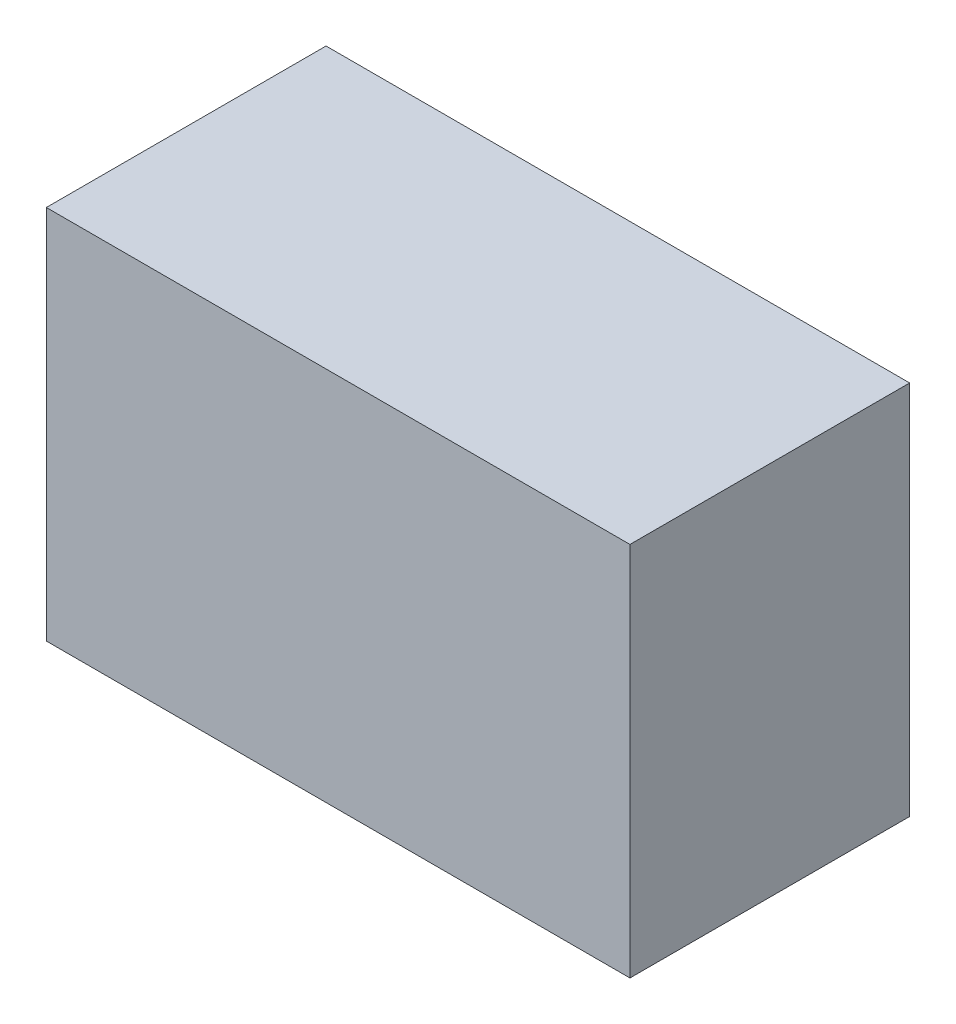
ISO-10303-21;
HEADER;
FILE_DESCRIPTION(('STEP AP214'),'2;1');
FILE_NAME('part.step','',(''),(''),'','','');
FILE_SCHEMA(('AUTOMOTIVE_DESIGN { 1 0 10303 214 1 1 1 1 }'));
ENDSEC;
DATA;
#1=APPLICATION_CONTEXT('core data for automotive mechanical design processes');
#2=APPLICATION_PROTOCOL_DEFINITION('international standard','automotive_design',2000,#1);
#3=PRODUCT_CONTEXT('',#1,'mechanical');
#4=PRODUCT('Part','Part','',(#3));
#5=PRODUCT_RELATED_PRODUCT_CATEGORY('part','',(#4));
#6=PRODUCT_DEFINITION_FORMATION('','',#4);
#7=PRODUCT_DEFINITION_CONTEXT('part definition',#1,'design');
#8=PRODUCT_DEFINITION('design','',#6,#7);
#9=PRODUCT_DEFINITION_SHAPE('','',#8);
#10=(LENGTH_UNIT() NAMED_UNIT(*) SI_UNIT(.MILLI.,.METRE.));
#11=(NAMED_UNIT(*) PLANE_ANGLE_UNIT() SI_UNIT($,.RADIAN.));
#12=(NAMED_UNIT(*) SI_UNIT($,.STERADIAN.) SOLID_ANGLE_UNIT());
#13=UNCERTAINTY_MEASURE_WITH_UNIT(LENGTH_MEASURE(1.E-05),#10,'distance_accuracy_value','');
#14=(GEOMETRIC_REPRESENTATION_CONTEXT(3) GLOBAL_UNCERTAINTY_ASSIGNED_CONTEXT((#13)) GLOBAL_UNIT_ASSIGNED_CONTEXT((#10,
#11,#12)) REPRESENTATION_CONTEXT('',''));
#15=CARTESIAN_POINT('',(0.,0.,0.));
#16=DIRECTION('',(0.,0.,1.));
#17=DIRECTION('',(1.,0.,0.));
#18=AXIS2_PLACEMENT_3D('',#15,#16,#17);
#19=CARTESIAN_POINT('',(-2.7499999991,1.70000000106,2.54));
#20=DIRECTION('',(1.,0.,0.));
#21=DIRECTION('',(0.,0.,-1.));
#22=AXIS2_PLACEMENT_3D('',#19,#20,#21);
#23=PLANE('',#22);
#24=DIRECTION('',(0.,-1.,0.));
#25=VECTOR('',#24,1.);
#26=CARTESIAN_POINT('',(-2.7499999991,1.70000000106,0.));
#27=LINE('',#26,#25);
#28=CARTESIAN_POINT('',(-2.7499999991,1.70000000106,0.));
#29=VERTEX_POINT('',#28);
#30=CARTESIAN_POINT('',(-2.7499999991,-1.70999999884,0.));
#31=VERTEX_POINT('',#30);
#32=EDGE_CURVE('E96',#29,#31,#27,.T.);
#33=ORIENTED_EDGE('',*,*,#32,.T.);
#34=DIRECTION('',(0.,0.,-1.));
#35=VECTOR('',#34,1.);
#36=CARTESIAN_POINT('',(-2.7499999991,-1.70999999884,2.54));
#37=LINE('',#36,#35);
#38=CARTESIAN_POINT('',(-2.7499999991,-1.70999999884,2.54));
#39=VERTEX_POINT('',#38);
#40=EDGE_CURVE('E11',#39,#31,#37,.T.);
#41=ORIENTED_EDGE('',*,*,#40,.F.);
#42=DIRECTION('',(0.,-1.,0.));
#43=VECTOR('',#42,1.);
#44=CARTESIAN_POINT('',(-2.7499999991,1.70000000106,2.54));
#45=LINE('',#44,#43);
#46=CARTESIAN_POINT('',(-2.7499999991,1.70000000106,2.54));
#47=VERTEX_POINT('',#46);
#48=EDGE_CURVE('E84',#47,#39,#45,.T.);
#49=ORIENTED_EDGE('',*,*,#48,.F.);
#50=DIRECTION('',(0.,0.,-1.));
#51=VECTOR('',#50,1.);
#52=CARTESIAN_POINT('',(-2.7499999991,1.70000000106,2.54));
#53=LINE('',#52,#51);
#54=EDGE_CURVE('E92',#47,#29,#53,.T.);
#55=ORIENTED_EDGE('',*,*,#54,.T.);
#56=EDGE_LOOP('',(#33,#41,#49,#55));
#57=FACE_BOUND('',#56,.T.);
#58=ADVANCED_FACE('F33',(#57),#23,.F.);
#59=CARTESIAN_POINT('',(-2.7499999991,-1.70999999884,2.54));
#60=DIRECTION('',(0.,1.,0.));
#61=DIRECTION('',(0.,0.,1.));
#62=AXIS2_PLACEMENT_3D('',#59,#60,#61);
#63=PLANE('',#62);
#64=DIRECTION('',(1.,0.,0.));
#65=VECTOR('',#64,1.);
#66=CARTESIAN_POINT('',(-2.7499999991,-1.70999999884,0.));
#67=LINE('',#66,#65);
#68=CARTESIAN_POINT('',(2.55000000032,-1.70999999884,0.));
#69=VERTEX_POINT('',#68);
#70=EDGE_CURVE('E88',#31,#69,#67,.T.);
#71=ORIENTED_EDGE('',*,*,#70,.T.);
#72=DIRECTION('',(0.,0.,-1.));
#73=VECTOR('',#72,1.);
#74=CARTESIAN_POINT('',(2.55000000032,-1.70999999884,2.54));
#75=LINE('',#74,#73);
#76=CARTESIAN_POINT('',(2.55000000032,-1.70999999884,2.54));
#77=VERTEX_POINT('',#76);
#78=EDGE_CURVE('E41',#77,#69,#75,.T.);
#79=ORIENTED_EDGE('',*,*,#78,.F.);
#80=DIRECTION('',(1.,0.,0.));
#81=VECTOR('',#80,1.);
#82=CARTESIAN_POINT('',(-2.7499999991,-1.70999999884,2.54));
#83=LINE('',#82,#81);
#84=EDGE_CURVE('E79',#39,#77,#83,.T.);
#85=ORIENTED_EDGE('',*,*,#84,.F.);
#86=ORIENTED_EDGE('',*,*,#40,.T.);
#87=EDGE_LOOP('',(#71,#79,#85,#86));
#88=FACE_BOUND('',#87,.T.);
#89=ADVANCED_FACE('F87',(#88),#63,.F.);
#90=CARTESIAN_POINT('',(2.55000000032,-1.70999999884,2.54));
#91=DIRECTION('',(-1.,0.,0.));
#92=DIRECTION('',(0.,0.,1.));
#93=AXIS2_PLACEMENT_3D('',#90,#91,#92);
#94=PLANE('',#93);
#95=DIRECTION('',(0.,1.,0.));
#96=VECTOR('',#95,1.);
#97=CARTESIAN_POINT('',(2.55000000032,-1.70999999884,0.));
#98=LINE('',#97,#96);
#99=CARTESIAN_POINT('',(2.55000000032,1.70000000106,0.));
#100=VERTEX_POINT('',#99);
#101=EDGE_CURVE('E66',#69,#100,#98,.T.);
#102=ORIENTED_EDGE('',*,*,#101,.T.);
#103=DIRECTION('',(0.,0.,-1.));
#104=VECTOR('',#103,1.);
#105=CARTESIAN_POINT('',(2.55000000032,1.70000000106,2.54));
#106=LINE('',#105,#104);
#107=CARTESIAN_POINT('',(2.55000000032,1.70000000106,2.54));
#108=VERTEX_POINT('',#107);
#109=EDGE_CURVE('E89',#108,#100,#106,.T.);
#110=ORIENTED_EDGE('',*,*,#109,.F.);
#111=DIRECTION('',(0.,1.,0.));
#112=VECTOR('',#111,1.);
#113=CARTESIAN_POINT('',(2.55000000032,-1.70999999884,2.54));
#114=LINE('',#113,#112);
#115=EDGE_CURVE('E82',#77,#108,#114,.T.);
#116=ORIENTED_EDGE('',*,*,#115,.F.);
#117=ORIENTED_EDGE('',*,*,#78,.T.);
#118=EDGE_LOOP('',(#102,#110,#116,#117));
#119=FACE_BOUND('',#118,.T.);
#120=ADVANCED_FACE('F90',(#119),#94,.F.);
#121=CARTESIAN_POINT('',(2.55000000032,1.70000000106,2.54));
#122=DIRECTION('',(0.,-1.,0.));
#123=DIRECTION('',(0.,0.,-1.));
#124=AXIS2_PLACEMENT_3D('',#121,#122,#123);
#125=PLANE('',#124);
#126=DIRECTION('',(-1.,0.,0.));
#127=VECTOR('',#126,1.);
#128=CARTESIAN_POINT('',(2.55000000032,1.70000000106,0.));
#129=LINE('',#128,#127);
#130=EDGE_CURVE('E72',#100,#29,#129,.T.);
#131=ORIENTED_EDGE('',*,*,#130,.T.);
#132=ORIENTED_EDGE('',*,*,#54,.F.);
#133=DIRECTION('',(-1.,0.,0.));
#134=VECTOR('',#133,1.);
#135=CARTESIAN_POINT('',(2.55000000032,1.70000000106,2.54));
#136=LINE('',#135,#134);
#137=EDGE_CURVE('E49',#108,#47,#136,.T.);
#138=ORIENTED_EDGE('',*,*,#137,.F.);
#139=ORIENTED_EDGE('',*,*,#109,.T.);
#140=EDGE_LOOP('',(#131,#132,#138,#139));
#141=FACE_BOUND('',#140,.T.);
#142=ADVANCED_FACE('F103',(#141),#125,.F.);
#143=CARTESIAN_POINT('',(0.,0.,2.54));
#144=DIRECTION('',(0.,0.,1.));
#145=DIRECTION('',(1.,0.,0.));
#146=AXIS2_PLACEMENT_3D('',#143,#144,#145);
#147=PLANE('',#146);
#148=ORIENTED_EDGE('',*,*,#48,.T.);
#149=ORIENTED_EDGE('',*,*,#84,.T.);
#150=ORIENTED_EDGE('',*,*,#115,.T.);
#151=ORIENTED_EDGE('',*,*,#137,.T.);
#152=EDGE_LOOP('',(#148,#149,#150,#151));
#153=FACE_BOUND('',#152,.T.);
#154=ADVANCED_FACE('F80',(#153),#147,.T.);
#155=CARTESIAN_POINT('',(0.,0.,0.));
#156=DIRECTION('',(0.,0.,1.));
#157=DIRECTION('',(1.,0.,0.));
#158=AXIS2_PLACEMENT_3D('',#155,#156,#157);
#159=PLANE('',#158);
#160=ORIENTED_EDGE('',*,*,#32,.F.);
#161=ORIENTED_EDGE('',*,*,#130,.F.);
#162=ORIENTED_EDGE('',*,*,#101,.F.);
#163=ORIENTED_EDGE('',*,*,#70,.F.);
#164=EDGE_LOOP('',(#160,#161,#162,#163));
#165=FACE_BOUND('',#164,.T.);
#166=ADVANCED_FACE('F106',(#165),#159,.F.);
#167=CLOSED_SHELL('',(#58,#89,#120,#142,#154,#166));
#168=MANIFOLD_SOLID_BREP('B2',#167);
#169=ADVANCED_BREP_SHAPE_REPRESENTATION('',(#18,#168),#14);
#170=SHAPE_DEFINITION_REPRESENTATION(#9,#169);
ENDSEC;
END-ISO-10303-21;
